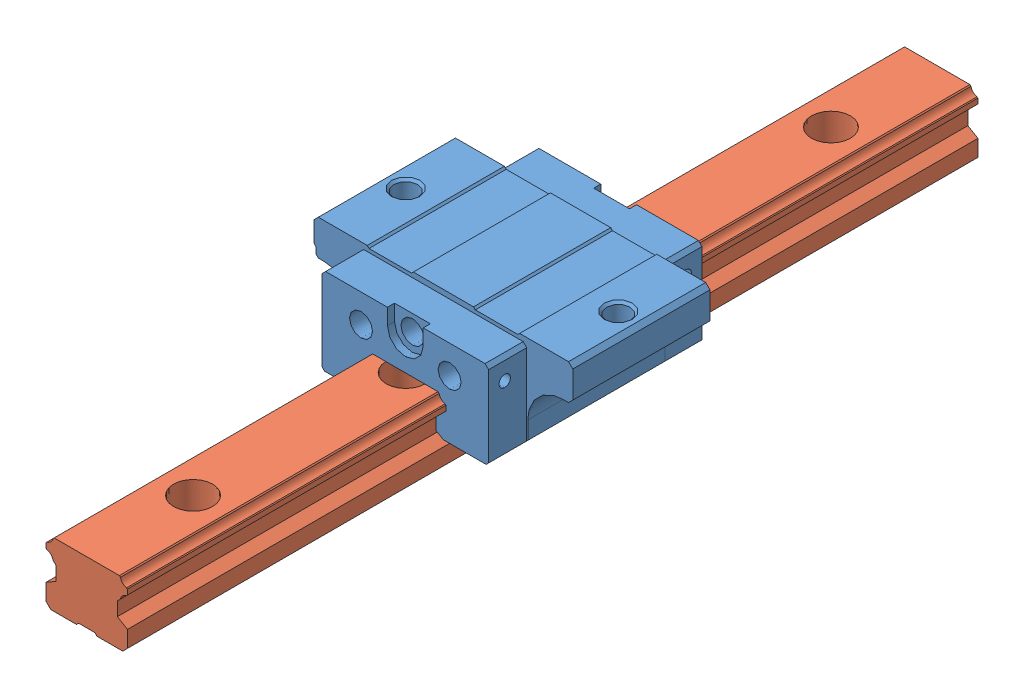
SolidWorks assembly ELW25CC1R240 E=30.sldasm, configuration Default (file format 13000). Lengths in mm.
Overall size (73 33.01 240).
2 component instances, 2 part files, 0 mates.
Components (placement in the parent):
- ELW25CC-1: ELW25CC.SLDPRT [Default] at (0 33 -89.9) size (73 26 60.2)
- ELR25R240 E=30-1: ELR25R240 E=30.SLDPRT [Default] at (0 33 0) size (23 18 240)
